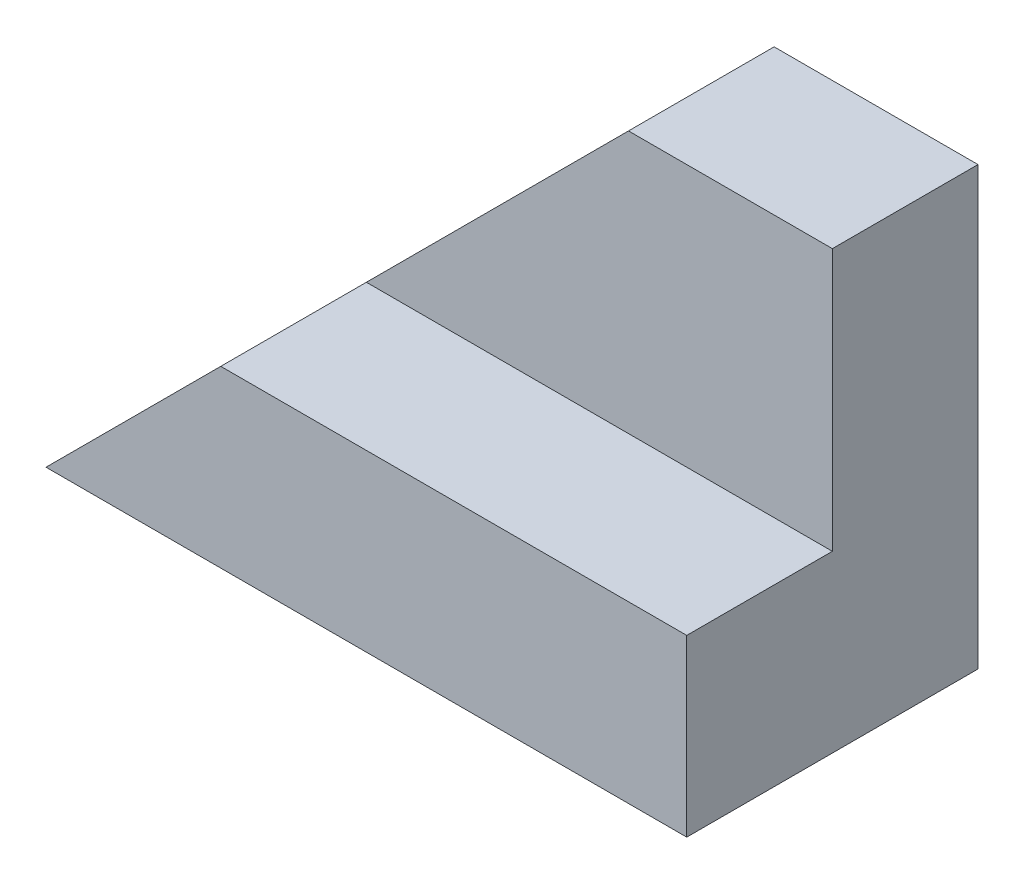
ISO-10303-21;
HEADER;
FILE_DESCRIPTION(('STEP AP214'),'2;1');
FILE_NAME('part.step','',(''),(''),'','','');
FILE_SCHEMA(('AUTOMOTIVE_DESIGN { 1 0 10303 214 1 1 1 1 }'));
ENDSEC;
DATA;
#1=APPLICATION_CONTEXT('core data for automotive mechanical design processes');
#2=APPLICATION_PROTOCOL_DEFINITION('international standard','automotive_design',2000,#1);
#3=PRODUCT_CONTEXT('',#1,'mechanical');
#4=PRODUCT('Part','Part','',(#3));
#5=PRODUCT_RELATED_PRODUCT_CATEGORY('part','',(#4));
#6=PRODUCT_DEFINITION_FORMATION('','',#4);
#7=PRODUCT_DEFINITION_CONTEXT('part definition',#1,'design');
#8=PRODUCT_DEFINITION('design','',#6,#7);
#9=PRODUCT_DEFINITION_SHAPE('','',#8);
#10=(LENGTH_UNIT() NAMED_UNIT(*) SI_UNIT(.MILLI.,.METRE.));
#11=(NAMED_UNIT(*) PLANE_ANGLE_UNIT() SI_UNIT($,.RADIAN.));
#12=(NAMED_UNIT(*) SI_UNIT($,.STERADIAN.) SOLID_ANGLE_UNIT());
#13=UNCERTAINTY_MEASURE_WITH_UNIT(LENGTH_MEASURE(1.E-05),#10,'distance_accuracy_value','');
#14=(GEOMETRIC_REPRESENTATION_CONTEXT(3) GLOBAL_UNCERTAINTY_ASSIGNED_CONTEXT((#13)) GLOBAL_UNIT_ASSIGNED_CONTEXT((#10,
#11,#12)) REPRESENTATION_CONTEXT('',''));
#15=CARTESIAN_POINT('',(0.,0.,0.));
#16=DIRECTION('',(0.,0.,1.));
#17=DIRECTION('',(1.,0.,0.));
#18=AXIS2_PLACEMENT_3D('',#15,#16,#17);
#19=CARTESIAN_POINT('',(75.,75.,50.));
#20=DIRECTION('',(0.707106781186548,-0.707106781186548,0.));
#21=DIRECTION('',(0.707106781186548,0.707106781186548,0.));
#22=AXIS2_PLACEMENT_3D('',#19,#20,#21);
#23=PLANE('',#22);
#24=DIRECTION('',(-0.707106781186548,-0.707106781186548,0.));
#25=VECTOR('',#24,1.);
#26=CARTESIAN_POINT('',(75.,75.,50.));
#27=LINE('',#26,#25);
#28=CARTESIAN_POINT('',(30.,30.,50.));
#29=VERTEX_POINT('',#28);
#30=CARTESIAN_POINT('',(0.,0.,50.));
#31=VERTEX_POINT('',#30);
#32=EDGE_CURVE('E94',#29,#31,#27,.T.);
#33=ORIENTED_EDGE('',*,*,#32,.F.);
#34=DIRECTION('',(0.,0.,1.));
#35=VECTOR('',#34,1.);
#36=CARTESIAN_POINT('',(30.,30.,25.));
#37=LINE('',#36,#35);
#38=CARTESIAN_POINT('',(30.,30.,25.));
#39=VERTEX_POINT('',#38);
#40=EDGE_CURVE('E45',#39,#29,#37,.T.);
#41=ORIENTED_EDGE('',*,*,#40,.F.);
#42=DIRECTION('',(-0.707106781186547,-0.707106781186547,0.));
#43=VECTOR('',#42,1.);
#44=CARTESIAN_POINT('',(30.,30.,25.));
#45=LINE('',#44,#43);
#46=CARTESIAN_POINT('',(75.,75.,25.));
#47=VERTEX_POINT('',#46);
#48=EDGE_CURVE('E81',#47,#39,#45,.T.);
#49=ORIENTED_EDGE('',*,*,#48,.F.);
#50=DIRECTION('',(0.,0.,-1.));
#51=VECTOR('',#50,1.);
#52=CARTESIAN_POINT('',(75.,75.,50.));
#53=LINE('',#52,#51);
#54=CARTESIAN_POINT('',(75.,75.,0.));
#55=VERTEX_POINT('',#54);
#56=EDGE_CURVE('E74',#47,#55,#53,.T.);
#57=ORIENTED_EDGE('',*,*,#56,.T.);
#58=DIRECTION('',(-0.707106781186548,-0.707106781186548,0.));
#59=VECTOR('',#58,1.);
#60=CARTESIAN_POINT('',(75.,75.,0.));
#61=LINE('',#60,#59);
#62=CARTESIAN_POINT('',(0.,0.,0.));
#63=VERTEX_POINT('',#62);
#64=EDGE_CURVE('E79',#55,#63,#61,.T.);
#65=ORIENTED_EDGE('',*,*,#64,.T.);
#66=DIRECTION('',(0.,0.,-1.));
#67=VECTOR('',#66,1.);
#68=CARTESIAN_POINT('',(0.,0.,50.));
#69=LINE('',#68,#67);
#70=EDGE_CURVE('E11',#31,#63,#69,.T.);
#71=ORIENTED_EDGE('',*,*,#70,.F.);
#72=EDGE_LOOP('',(#33,#41,#49,#57,#65,#71));
#73=FACE_BOUND('',#72,.T.);
#74=ADVANCED_FACE('F31',(#73),#23,.F.);
#75=CARTESIAN_POINT('',(0.,0.,50.));
#76=DIRECTION('',(0.,1.,0.));
#77=DIRECTION('',(0.,0.,1.));
#78=AXIS2_PLACEMENT_3D('',#75,#76,#77);
#79=PLANE('',#78);
#80=DIRECTION('',(1.,0.,0.));
#81=VECTOR('',#80,1.);
#82=CARTESIAN_POINT('',(0.,0.,0.));
#83=LINE('',#82,#81);
#84=CARTESIAN_POINT('',(110.,0.,0.));
#85=VERTEX_POINT('',#84);
#86=EDGE_CURVE('E98',#63,#85,#83,.T.);
#87=ORIENTED_EDGE('',*,*,#86,.T.);
#88=DIRECTION('',(0.,0.,-1.));
#89=VECTOR('',#88,1.);
#90=CARTESIAN_POINT('',(110.,0.,50.));
#91=LINE('',#90,#89);
#92=CARTESIAN_POINT('',(110.,0.,50.));
#93=VERTEX_POINT('',#92);
#94=EDGE_CURVE('E38',#93,#85,#91,.T.);
#95=ORIENTED_EDGE('',*,*,#94,.F.);
#96=DIRECTION('',(1.,0.,0.));
#97=VECTOR('',#96,1.);
#98=CARTESIAN_POINT('',(0.,0.,50.));
#99=LINE('',#98,#97);
#100=EDGE_CURVE('E54',#31,#93,#99,.T.);
#101=ORIENTED_EDGE('',*,*,#100,.F.);
#102=ORIENTED_EDGE('',*,*,#70,.T.);
#103=EDGE_LOOP('',(#87,#95,#101,#102));
#104=FACE_BOUND('',#103,.T.);
#105=ADVANCED_FACE('F114',(#104),#79,.F.);
#106=CARTESIAN_POINT('',(110.,0.,50.));
#107=DIRECTION('',(-1.,0.,0.));
#108=DIRECTION('',(0.,0.,1.));
#109=AXIS2_PLACEMENT_3D('',#106,#107,#108);
#110=PLANE('',#109);
#111=DIRECTION('',(0.,1.,0.));
#112=VECTOR('',#111,1.);
#113=CARTESIAN_POINT('',(110.,75.,25.));
#114=LINE('',#113,#112);
#115=CARTESIAN_POINT('',(110.,30.,25.));
#116=VERTEX_POINT('',#115);
#117=CARTESIAN_POINT('',(110.,75.,25.));
#118=VERTEX_POINT('',#117);
#119=EDGE_CURVE('E124',#116,#118,#114,.T.);
#120=ORIENTED_EDGE('',*,*,#119,.F.);
#121=DIRECTION('',(0.,0.,1.));
#122=VECTOR('',#121,1.);
#123=CARTESIAN_POINT('',(110.,30.,25.));
#124=LINE('',#123,#122);
#125=CARTESIAN_POINT('',(110.,30.,50.));
#126=VERTEX_POINT('',#125);
#127=EDGE_CURVE('E99',#116,#126,#124,.T.);
#128=ORIENTED_EDGE('',*,*,#127,.T.);
#129=DIRECTION('',(0.,1.,0.));
#130=VECTOR('',#129,1.);
#131=CARTESIAN_POINT('',(110.,0.,50.));
#132=LINE('',#131,#130);
#133=EDGE_CURVE('E85',#93,#126,#132,.T.);
#134=ORIENTED_EDGE('',*,*,#133,.F.);
#135=ORIENTED_EDGE('',*,*,#94,.T.);
#136=DIRECTION('',(0.,1.,0.));
#137=VECTOR('',#136,1.);
#138=CARTESIAN_POINT('',(110.,0.,0.));
#139=LINE('',#138,#137);
#140=CARTESIAN_POINT('',(110.,75.,0.));
#141=VERTEX_POINT('',#140);
#142=EDGE_CURVE('E95',#85,#141,#139,.T.);
#143=ORIENTED_EDGE('',*,*,#142,.T.);
#144=DIRECTION('',(0.,0.,-1.));
#145=VECTOR('',#144,1.);
#146=CARTESIAN_POINT('',(110.,75.,50.));
#147=LINE('',#146,#145);
#148=EDGE_CURVE('E84',#118,#141,#147,.T.);
#149=ORIENTED_EDGE('',*,*,#148,.F.);
#150=EDGE_LOOP('',(#120,#128,#134,#135,#143,#149));
#151=FACE_BOUND('',#150,.T.);
#152=ADVANCED_FACE('F112',(#151),#110,.F.);
#153=CARTESIAN_POINT('',(110.,75.,50.));
#154=DIRECTION('',(0.,-1.,0.));
#155=DIRECTION('',(0.,0.,-1.));
#156=AXIS2_PLACEMENT_3D('',#153,#154,#155);
#157=PLANE('',#156);
#158=ORIENTED_EDGE('',*,*,#56,.F.);
#159=DIRECTION('',(-1.,0.,0.));
#160=VECTOR('',#159,1.);
#161=CARTESIAN_POINT('',(75.,75.,25.));
#162=LINE('',#161,#160);
#163=EDGE_CURVE('E118',#118,#47,#162,.T.);
#164=ORIENTED_EDGE('',*,*,#163,.F.);
#165=ORIENTED_EDGE('',*,*,#148,.T.);
#166=DIRECTION('',(-1.,0.,0.));
#167=VECTOR('',#166,1.);
#168=CARTESIAN_POINT('',(110.,75.,0.));
#169=LINE('',#168,#167);
#170=EDGE_CURVE('E88',#141,#55,#169,.T.);
#171=ORIENTED_EDGE('',*,*,#170,.T.);
#172=EDGE_LOOP('',(#158,#164,#165,#171));
#173=FACE_BOUND('',#172,.T.);
#174=ADVANCED_FACE('F89',(#173),#157,.F.);
#175=CARTESIAN_POINT('',(0.,0.,50.));
#176=DIRECTION('',(0.,0.,1.));
#177=DIRECTION('',(1.,0.,0.));
#178=AXIS2_PLACEMENT_3D('',#175,#176,#177);
#179=PLANE('',#178);
#180=DIRECTION('',(1.,0.,0.));
#181=VECTOR('',#180,1.);
#182=CARTESIAN_POINT('',(110.,30.,50.));
#183=LINE('',#182,#181);
#184=EDGE_CURVE('E120',#29,#126,#183,.T.);
#185=ORIENTED_EDGE('',*,*,#184,.F.);
#186=ORIENTED_EDGE('',*,*,#32,.T.);
#187=ORIENTED_EDGE('',*,*,#100,.T.);
#188=ORIENTED_EDGE('',*,*,#133,.T.);
#189=EDGE_LOOP('',(#185,#186,#187,#188));
#190=FACE_BOUND('',#189,.T.);
#191=ADVANCED_FACE('F140',(#190),#179,.T.);
#192=CARTESIAN_POINT('',(0.,0.,0.));
#193=DIRECTION('',(0.,0.,1.));
#194=DIRECTION('',(1.,0.,0.));
#195=AXIS2_PLACEMENT_3D('',#192,#193,#194);
#196=PLANE('',#195);
#197=ORIENTED_EDGE('',*,*,#64,.F.);
#198=ORIENTED_EDGE('',*,*,#170,.F.);
#199=ORIENTED_EDGE('',*,*,#142,.F.);
#200=ORIENTED_EDGE('',*,*,#86,.F.);
#201=EDGE_LOOP('',(#197,#198,#199,#200));
#202=FACE_BOUND('',#201,.T.);
#203=ADVANCED_FACE('F97',(#202),#196,.F.);
#204=CARTESIAN_POINT('',(110.,30.,25.));
#205=DIRECTION('',(0.,-1.,0.));
#206=DIRECTION('',(1.,0.,0.));
#207=AXIS2_PLACEMENT_3D('',#204,#205,#206);
#208=PLANE('',#207);
#209=ORIENTED_EDGE('',*,*,#184,.T.);
#210=ORIENTED_EDGE('',*,*,#127,.F.);
#211=DIRECTION('',(1.,0.,0.));
#212=VECTOR('',#211,1.);
#213=CARTESIAN_POINT('',(110.,30.,25.));
#214=LINE('',#213,#212);
#215=EDGE_CURVE('E127',#39,#116,#214,.T.);
#216=ORIENTED_EDGE('',*,*,#215,.F.);
#217=ORIENTED_EDGE('',*,*,#40,.T.);
#218=EDGE_LOOP('',(#209,#210,#216,#217));
#219=FACE_BOUND('',#218,.T.);
#220=ADVANCED_FACE('F141',(#219),#208,.F.);
#221=CARTESIAN_POINT('',(110.,110.,25.));
#222=DIRECTION('',(0.,0.,-1.));
#223=DIRECTION('',(-1.,0.,0.));
#224=AXIS2_PLACEMENT_3D('',#221,#222,#223);
#225=PLANE('',#224);
#226=ORIENTED_EDGE('',*,*,#48,.T.);
#227=ORIENTED_EDGE('',*,*,#215,.T.);
#228=ORIENTED_EDGE('',*,*,#119,.T.);
#229=ORIENTED_EDGE('',*,*,#163,.T.);
#230=EDGE_LOOP('',(#226,#227,#228,#229));
#231=FACE_BOUND('',#230,.T.);
#232=ADVANCED_FACE('F131',(#231),#225,.F.);
#233=CLOSED_SHELL('',(#74,#105,#152,#174,#191,#203,#220,#232));
#234=MANIFOLD_SOLID_BREP('B2',#233);
#235=ADVANCED_BREP_SHAPE_REPRESENTATION('',(#18,#234),#14);
#236=SHAPE_DEFINITION_REPRESENTATION(#9,#235);
ENDSEC;
END-ISO-10303-21;
